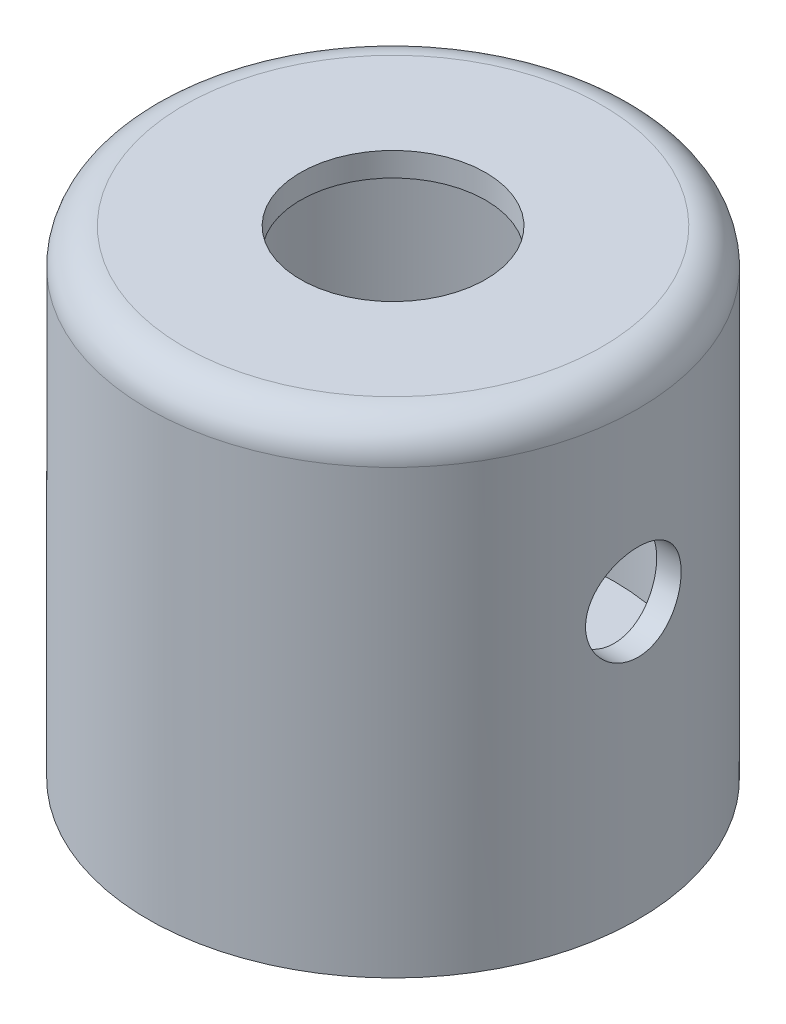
from build123d import *

# Parameters (mm, degrees)
CONG_1_R    = 3
CONG_2_R    = 1
ESQUISSE2_W = 10.034456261
ESQUISSE2_H = 4


with BuildPart() as part:
    # Esquisse1 → Base-R_volution (revolve)
    with BuildSketch(Plane.XY, mode=Mode.PRIVATE) as base_r_volution_sk:
        Polygon((18.5, 0), (18.5, 3), (7.75, 3), (7.75, 5), (18.5, 5), (18.5, 38), (7.75, 38), (7.75, 40), (20.5, 40), (20.5, 0), align=None)
    revolve(base_r_volution_sk.sketch.rotate(Axis((0, -16.664720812, 0), (0, 1, 0)), 90), axis=Axis((0, -16.664720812, 0), (0, 1, 0)))

    # Cong_1
    cong_1_edges = [part.edges().sort_by_distance(p)[0] for p in [
        (0, 40, 20.5),
    ]]
    fillet(cong_1_edges, radius=CONG_1_R)

    # Cong_2
    cong_2_edges = [part.edges().sort_by_distance(p)[0] for p in [
        (0, 38, 18.5),
    ]]
    fillet(cong_2_edges, radius=CONG_2_R)

    # Esquisse2 → Enl_vement de mati_re-R_volution1 (revolve, cut)
    with BuildSketch(Plane.XY, mode=Mode.PRIVATE) as enl_vement_de_mati_re_r_volution1_sk:
        with Locations((17.996579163, 25)):
            Rectangle(ESQUISSE2_W, ESQUISSE2_H)
    revolve(enl_vement_de_mati_re_r_volution1_sk.sketch.rotate(Axis((16.033315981, 23, 0), (1, 0, 0)), 90), axis=Axis((16.033315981, 23, 0), (1, 0, 0)), mode=Mode.SUBTRACT)


solid = part.part
